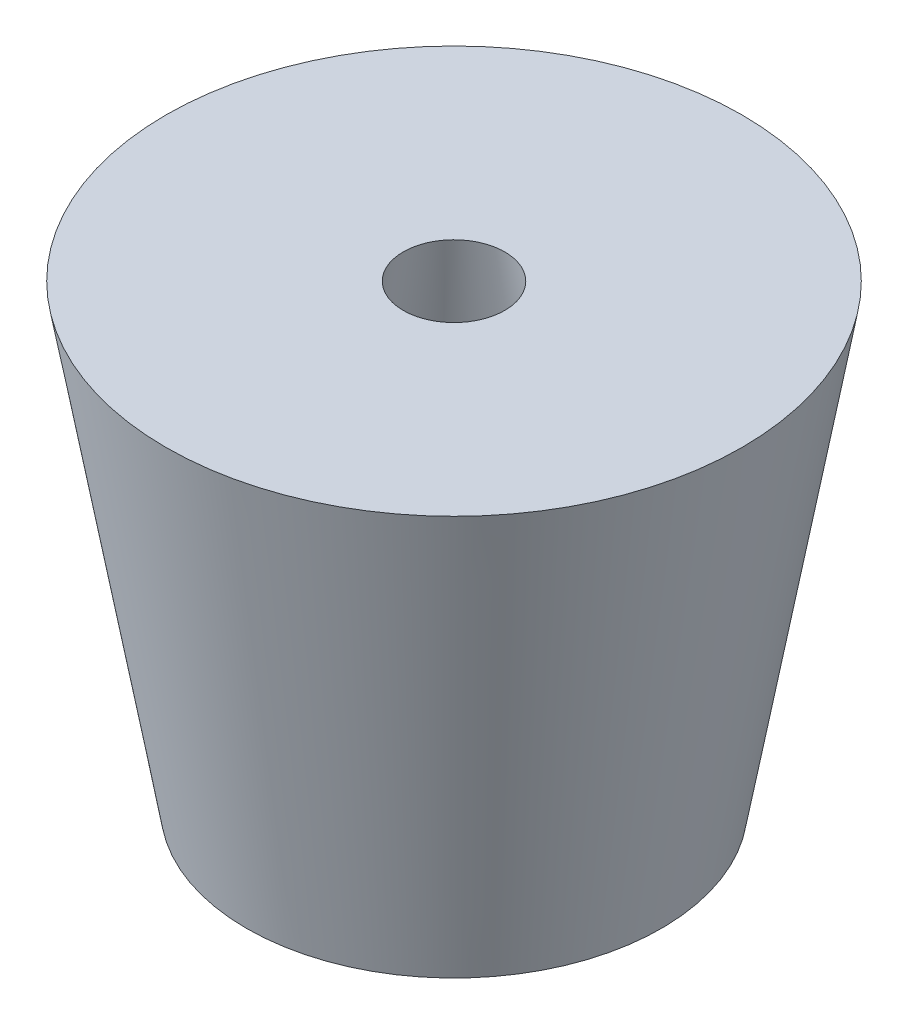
ISO-10303-21;
HEADER;
FILE_DESCRIPTION(('STEP AP214'),'2;1');
FILE_NAME('part.step','',(''),(''),'','','');
FILE_SCHEMA(('AUTOMOTIVE_DESIGN { 1 0 10303 214 1 1 1 1 }'));
ENDSEC;
DATA;
#1=APPLICATION_CONTEXT('core data for automotive mechanical design processes');
#2=APPLICATION_PROTOCOL_DEFINITION('international standard','automotive_design',2000,#1);
#3=PRODUCT_CONTEXT('',#1,'mechanical');
#4=PRODUCT('Part','Part','',(#3));
#5=PRODUCT_RELATED_PRODUCT_CATEGORY('part','',(#4));
#6=PRODUCT_DEFINITION_FORMATION('','',#4);
#7=PRODUCT_DEFINITION_CONTEXT('part definition',#1,'design');
#8=PRODUCT_DEFINITION('design','',#6,#7);
#9=PRODUCT_DEFINITION_SHAPE('','',#8);
#10=(LENGTH_UNIT() NAMED_UNIT(*) SI_UNIT(.MILLI.,.METRE.));
#11=(NAMED_UNIT(*) PLANE_ANGLE_UNIT() SI_UNIT($,.RADIAN.));
#12=(NAMED_UNIT(*) SI_UNIT($,.STERADIAN.) SOLID_ANGLE_UNIT());
#13=UNCERTAINTY_MEASURE_WITH_UNIT(LENGTH_MEASURE(1.E-05),#10,'distance_accuracy_value','');
#14=(GEOMETRIC_REPRESENTATION_CONTEXT(3) GLOBAL_UNCERTAINTY_ASSIGNED_CONTEXT((#13)) GLOBAL_UNIT_ASSIGNED_CONTEXT((#10,
#11,#12)) REPRESENTATION_CONTEXT('',''));
#15=CARTESIAN_POINT('',(0.,0.,0.));
#16=DIRECTION('',(0.,0.,1.));
#17=DIRECTION('',(1.,0.,0.));
#18=AXIS2_PLACEMENT_3D('',#15,#16,#17);
#19=CARTESIAN_POINT('',(81.7388565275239,-180.852861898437,0.));
#20=DIRECTION('',(0.,1.,0.));
#21=DIRECTION('',(0.,0.,1.));
#22=AXIS2_PLACEMENT_3D('',#19,#20,#21);
#23=PLANE('',#22);
#24=CARTESIAN_POINT('',(0.,-180.852861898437,0.));
#25=DIRECTION('',(0.,1.,0.));
#26=DIRECTION('',(0.,0.,1.));
#27=AXIS2_PLACEMENT_3D('',#24,#25,#26);
#28=CIRCLE('',#27,81.7388565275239);
#29=CARTESIAN_POINT('',(0.,-180.852861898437,81.7388565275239));
#30=VERTEX_POINT('',#29);
#31=EDGE_CURVE('E360',#30,#30,#28,.T.);
#32=ORIENTED_EDGE('',*,*,#31,.F.);
#33=EDGE_LOOP('',(#32));
#34=FACE_BOUND('',#33,.T.);
#35=CARTESIAN_POINT('',(0.,-180.852861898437,0.));
#36=DIRECTION('',(0.,1.,0.));
#37=DIRECTION('',(0.,0.,1.));
#38=AXIS2_PLACEMENT_3D('',#35,#36,#37);
#39=CIRCLE('',#38,51.7388565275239);
#40=CARTESIAN_POINT('',(0.,-180.852861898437,51.7388565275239));
#41=VERTEX_POINT('',#40);
#42=EDGE_CURVE('E10',#41,#41,#39,.T.);
#43=ORIENTED_EDGE('',*,*,#42,.T.);
#44=EDGE_LOOP('',(#43));
#45=FACE_BOUND('',#44,.T.);
#46=ADVANCED_FACE('F346',(#34,#45),#23,.F.);
#47=CARTESIAN_POINT('',(0.,-0.852861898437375,0.));
#48=DIRECTION('',(0.,-1.,0.));
#49=DIRECTION('',(0.,0.,-1.));
#50=AXIS2_PLACEMENT_3D('',#47,#48,#49);
#51=CONICAL_SURFACE('',#50,20.,0.174532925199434);
#52=ORIENTED_EDGE('',*,*,#42,.F.);
#53=EDGE_LOOP('',(#52));
#54=FACE_BOUND('',#53,.T.);
#55=CARTESIAN_POINT('',(0.,-0.852861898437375,0.));
#56=DIRECTION('',(0.,1.,0.));
#57=DIRECTION('',(0.,0.,1.));
#58=AXIS2_PLACEMENT_3D('',#55,#56,#57);
#59=CIRCLE('',#58,20.);
#60=CARTESIAN_POINT('',(0.,-0.852861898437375,20.));
#61=VERTEX_POINT('',#60);
#62=EDGE_CURVE('E352',#61,#61,#59,.T.);
#63=ORIENTED_EDGE('',*,*,#62,.T.);
#64=EDGE_LOOP('',(#63));
#65=FACE_BOUND('',#64,.T.);
#66=ADVANCED_FACE('F369',(#54,#65),#51,.F.);
#67=CARTESIAN_POINT('',(20.,-0.852861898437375,0.));
#68=DIRECTION('',(0.,-1.,0.));
#69=DIRECTION('',(0.,0.,-1.));
#70=AXIS2_PLACEMENT_3D('',#67,#68,#69);
#71=PLANE('',#70);
#72=ORIENTED_EDGE('',*,*,#62,.F.);
#73=EDGE_LOOP('',(#72));
#74=FACE_BOUND('',#73,.T.);
#75=CARTESIAN_POINT('',(0.,-0.852861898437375,0.));
#76=DIRECTION('',(0.,1.,0.));
#77=DIRECTION('',(0.,0.,1.));
#78=AXIS2_PLACEMENT_3D('',#75,#76,#77);
#79=CIRCLE('',#78,113.477713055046);
#80=CARTESIAN_POINT('',(0.,-0.852861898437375,113.477713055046));
#81=VERTEX_POINT('',#80);
#82=EDGE_CURVE('E356',#81,#81,#79,.T.);
#83=ORIENTED_EDGE('',*,*,#82,.T.);
#84=EDGE_LOOP('',(#83));
#85=FACE_BOUND('',#84,.T.);
#86=ADVANCED_FACE('F373',(#74,#85),#71,.F.);
#87=CARTESIAN_POINT('',(0.,-180.852861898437,0.));
#88=DIRECTION('',(0.,1.,0.));
#89=DIRECTION('',(0.,0.,1.));
#90=AXIS2_PLACEMENT_3D('',#87,#88,#89);
#91=CONICAL_SURFACE('',#90,81.7388565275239,0.174532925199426);
#92=ORIENTED_EDGE('',*,*,#82,.F.);
#93=EDGE_LOOP('',(#92));
#94=FACE_BOUND('',#93,.T.);
#95=ORIENTED_EDGE('',*,*,#31,.T.);
#96=EDGE_LOOP('',(#95));
#97=FACE_BOUND('',#96,.T.);
#98=ADVANCED_FACE('F366',(#94,#97),#91,.T.);
#99=CLOSED_SHELL('',(#46,#66,#86,#98));
#100=MANIFOLD_SOLID_BREP('B2',#99);
#101=ADVANCED_BREP_SHAPE_REPRESENTATION('',(#18,#100),#14);
#102=SHAPE_DEFINITION_REPRESENTATION(#9,#101);
ENDSEC;
END-ISO-10303-21;
